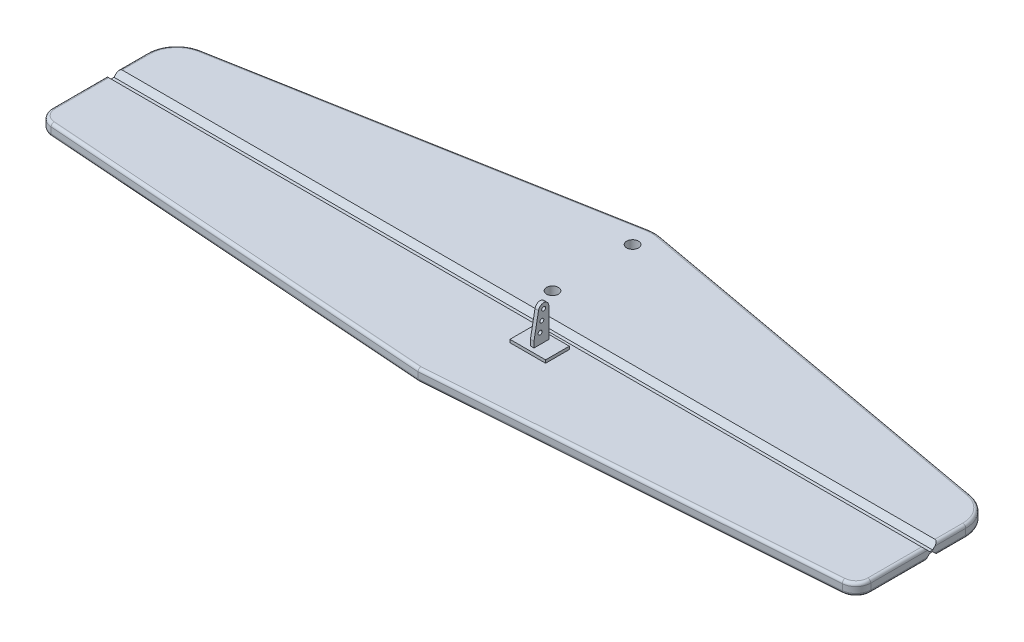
from build123d import *

# Parameters (mm, degrees)
ESQUISSE1_R             = 2
BOSS_EXTRU_1_DEPTH      = 4
ENL_V_MAT_EXTRU_1_DEPTH = 280.646879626
CONG_1_R                = 1
ESQUISSE4_W             = 12
ESQUISSE4_H             = 8
BOSS_EXTRU_2_DEPTH      = 1
ESQUISSE5_W             = 1.2
ESQUISSE5_H             = 5
BOSS_EXTRU_3_DEPTH      = 11.6
ESQUISSE6_R             = 0.65
ENL_V_MAT_EXTRU_2_DEPTH = 1.2


with BuildPart() as part:
    # Esquisse1 → Boss.-Extru.1 (new body)
    with BuildSketch(Plane(origin=(0, 0, 0), x_dir=(1, 0, 0), z_dir=(0, 1, 0))):
        with BuildLine():
            Line((0, -35), (133.361371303, -25.336132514))
            ThreePointArc((133.361371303, -25.336132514), (136.661069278, -23.754582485), (138, -20.349208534))
            Line((138, -20.349208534), (138, 11.648825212))
            ThreePointArc((138, 11.648825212), (135.675473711, 18.058747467), (129.782579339, 21.488663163))
            Line((129.782579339, 21.488663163), (1.782579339, 44.67706896))
            ThreePointArc((1.782579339, 44.67706896), (0, 44.837231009), (-1.782579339, 44.67706896))
            Line((-1.782579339, 44.67706896), (-129.782579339, 21.488663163))
            ThreePointArc((-129.782579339, 21.488663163), (-135.675473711, 18.058747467), (-138, 11.648825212))
            Line((-138, 11.648825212), (-138, -20.349208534))
            ThreePointArc((-138, -20.349208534), (-136.661069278, -23.754582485), (-133.361371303, -25.336132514))
            Line((-133.361371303, -25.336132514), (0, -35))
        make_face()
        with Locations(Location((0, 37.337231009, 0), (0, 0, 270))):
            Circle(ESQUISSE1_R, mode=Mode.SUBTRACT)
        with Locations(Location((0, 10.337231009, 0), (0, 0, 270))):
            Circle(ESQUISSE1_R, mode=Mode.SUBTRACT)
    extrude(amount=BOSS_EXTRU_1_DEPTH)

    # Esquisse3 → Enl_v. mat.-Extru.1 (cut, through all)
    with BuildSketch(Plane(origin=(138, 0, 0), x_dir=(0, 0, -1), z_dir=(1, 0, 0))):
        Polygon((0.5, 2.25), (-0.5, 2.25), (-2.25, 4), (2.25, 4), align=None)
        Polygon((0.5, 1.75), (2.25, 0), (-2.25, 0), (-0.5, 1.75), align=None)
    extrude(amount=-ENL_V_MAT_EXTRU_1_DEPTH, mode=Mode.SUBTRACT)

    # Cong_1
    cong_1_edges = [part.edges().sort_by_distance(p)[0] for p in [
        (136.661069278, 4, 23.754582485),
        (-136.661069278, 0, 23.754582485),
        (-138, 0, -6.949412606),
        (-135.675473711, 0, -18.058747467),
        (-65.782579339, 0, -33.082866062),
        (0, 0, -44.837231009),
        (65.782579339, 0, -33.082866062),
        (135.675473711, 0, -18.058747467),
        (138, 0, 11.299604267),
        (138, 4, 11.299604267),
        (136.661069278, 0, 23.754582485),
        (66.680685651, 0, 30.168066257),
        (-66.680685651, 0, 30.168066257),
        (135.675473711, 4, -18.058747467),
        (65.782579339, 4, -33.082866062),
        (0, 4, -44.837231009),
        (-65.782579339, 4, -33.082866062),
        (-135.675473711, 4, -18.058747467),
        (-138, 4, -6.949412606),
        (-136.661069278, 4, 23.754582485),
        (-138, 4, 11.299604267),
        (-66.680685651, 4, 30.168066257),
        (138, 4, -6.949412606),
        (-138, 0, 11.299604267),
        (138, 0, -6.949412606),
        (66.680685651, 4, 30.168066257),
    ]]
    fillet(cong_1_edges, radius=CONG_1_R)

    # Esquisse4 → Boss.-Extru.2 (add)
    with BuildSketch(Plane(origin=(0, 4, 0), x_dir=(1, 0, 0), z_dir=(0, 1, 0))):
        with Locations((14, -8)):
            Rectangle(ESQUISSE4_W, ESQUISSE4_H)
    extrude(amount=BOSS_EXTRU_2_DEPTH)

    # Esquisse5 → Boss.-Extru.3 (add)
    with BuildSketch(Plane(origin=(0, 5, 0), x_dir=(1, 0, 0), z_dir=(0, 1, 0))):
        with Locations((14, -8)):
            Rectangle(ESQUISSE5_W, ESQUISSE5_H)
    extrude(amount=BOSS_EXTRU_3_DEPTH)

    # Esquisse6 → Enl_v. mat.-Extru.2 (cut)
    with BuildSketch(Plane.ZY.offset(-13.4)):
        with Locations((7.25, 14.85)):
            Circle(ESQUISSE6_R)
        with Locations((7.848058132, 11.655500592)):
            Circle(ESQUISSE6_R)
        with Locations(Location((8.446116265, 8.461001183, 0), (0, 0, 180))):
            Circle(ESQUISSE6_R)
        with BuildLine():
            Line((8.970115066, 15.172031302), (10.500041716, 7))
            Line((10.500041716, 7), (10.500041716, 17.292810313))
            Line((10.500041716, 17.292810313), (5.5, 17.292810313))
            Line((5.5, 17.292810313), (5.5, 14.85))
            ThreePointArc((5.5, 14.85), (7.088292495, 16.59251275), (8.970115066, 15.172031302))
        make_face()
    extrude(amount=-ENL_V_MAT_EXTRU_2_DEPTH, mode=Mode.SUBTRACT)


solid = part.part
